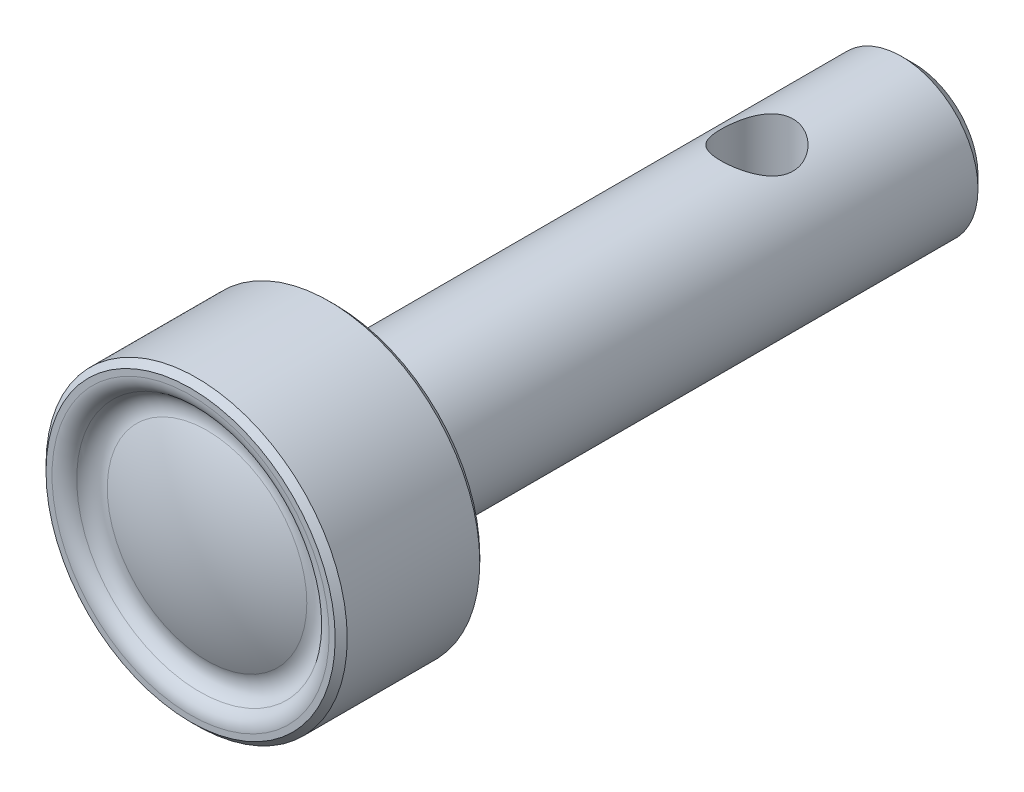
from build123d import *

# Parameters (mm, degrees)
SKETCH_2_R          = 3
CUT_EXTRUDE_1_DEPTH = 10


with BuildPart() as part:
    # Sketch 1 → Revolve 1 (revolve)
    with BuildSketch(Plane(origin=(0, 0, 0), x_dir=(0, 0, -1), z_dir=(1, 0, 0)), mode=Mode.PRIVATE) as revolve_1_sk:
        with BuildLine():
            Line((0, 0), (0, 5.35))
            Line((0, 5.35), (-1, 6.35))
            Line((-1, 6.35), (-48, 6.35))
            Line((-48, 6.35), (-48, 12))
            Line((-48, 12), (-48.5, 12.5))
            Line((-48.5, 12.5), (-59.5, 12.5))
            Line((-59.5, 12.5), (-60, 12))
            Line((-60, 12), (-60, 11.5))
            ThreePointArc((-60, 11.5), (-59.799038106, 10.75), (-59.25, 10.200961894))
            ThreePointArc((-59.25, 10.200961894), (-58.571569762, 9.359730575), (-58.634613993, 8.280859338))
            ThreePointArc((-58.634613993, 8.280859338), (-59.975604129, 4.236570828), (-60.429467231, 0))
            Line((-60.429467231, 0), (0, 0))
        make_face()
    revolve(revolve_1_sk.sketch.rotate(Axis((0, 0, 60.429467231), (0, 0, -1)), 90), axis=Axis((0, 0, 60.429467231), (0, 0, -1)))

    # Sketch 2 → Cut-Extrude 1 (cut, symmetric)
    with BuildSketch(Plane(origin=(0, 0, 0), x_dir=(1, 0, 0), z_dir=(0, 1, 0))):
        with Locations(Location((0, -13, 0), (0, 0, 270))):
            Circle(SKETCH_2_R)
    extrude(amount=CUT_EXTRUDE_1_DEPTH, both=True, mode=Mode.SUBTRACT)


solid = part.part
